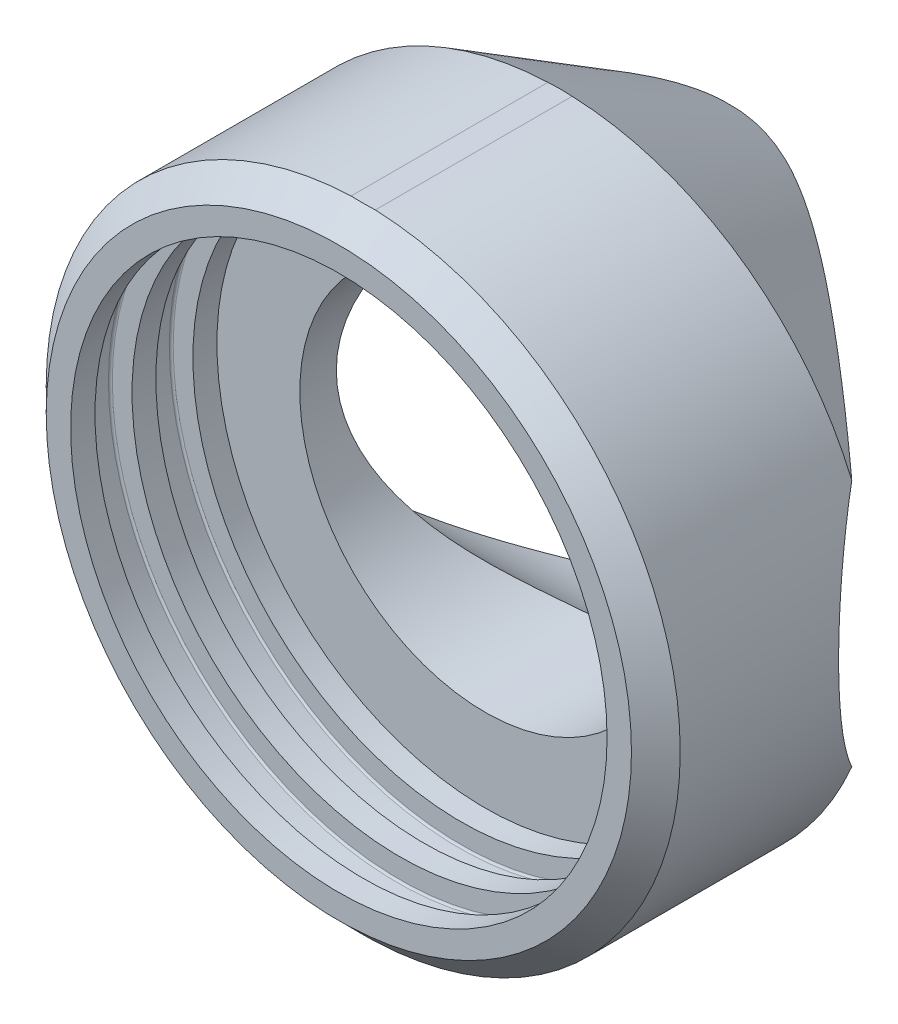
from build123d import *
from OCP.BRepFilletAPI import BRepFilletAPI_MakeChamfer

# Parameters (mm, degrees)
SKETCH1_R                = 41.275
BOSS_EXTRUDE1_DEPTH      = 50.8
SKETCH2_R                = 14.2875
CUT_EXTRUDE1_DEPTH       = 50.8
SKETCH3_R                = 34.925
CUT_EXTRUDE2_DEPTH       = 19.05
SKETCH4_R                = 24.13
CUT_EXTRUDE3_DEPTH       = 67.447827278
CUT_EXTRUDE6_DEPTH       = 78.381465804
CUT_EXTRUDE6_DEPTH_BACK  = 78.381465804
SKETCH5_R                = 28.575
CHAMFER1_SIZE            = 12.7
CHAMFER1_SIZE2           = 21.997045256
CHAMFER2_SIZE            = 3.175
CUT_EXTRUDE7_START       = -11.0998
SKETCH6_R                = 37.7444
CUT_EXTRUDE7_DEPTH       = 4.826
CUT_EXTRUDE8_START       = -3.175
SKETCH7_R                = 37.7444
CUT_EXTRUDE8_DEPTH       = 4.826
FILLET1_R                = 0.254
CUT_EXTRUDE9_DEPTH       = 78.381465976
CUT_EXTRUDE9_DEPTH_BACK  = 78.381465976
CUT_EXTRUDE10_DEPTH      = 78.381465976
CUT_EXTRUDE10_DEPTH_BACK = 78.381465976


with BuildPart() as part:
    # Sketch1 → Boss-Extrude1 (new body)
    with BuildSketch(Plane.XY):
        Circle(SKETCH1_R)
    extrude(amount=-BOSS_EXTRUDE1_DEPTH)

    # Sketch2 → Cut-Extrude1 (cut)
    with BuildSketch(Plane.XY):
        Circle(SKETCH2_R)
    extrude(amount=-CUT_EXTRUDE1_DEPTH, mode=Mode.SUBTRACT)

    # Sketch3 → Cut-Extrude2 (cut)
    with BuildSketch(Plane.XY):
        Circle(SKETCH3_R)
    extrude(amount=-CUT_EXTRUDE2_DEPTH, mode=Mode.SUBTRACT)

    # Sketch4 → Cut-Extrude3 (cut, through all)
    with BuildSketch(Plane.XY.offset(-19.05)):
        Circle(SKETCH4_R)
    extrude(amount=-CUT_EXTRUDE3_DEPTH, mode=Mode.SUBTRACT)

    # Sketch5 → Cut-Extrude6 (cut, two sides: drawn at the far end of the back side and taken through both)
    with BuildSketch(Plane(origin=(0, 0, 0), x_dir=(0, 0, -1), z_dir=(1, 0, 0)).offset(-CUT_EXTRUDE6_DEPTH_BACK)):
        with Locations((52.3748, 0)):
            Circle(SKETCH5_R)
    extrude(amount=CUT_EXTRUDE6_DEPTH + CUT_EXTRUDE6_DEPTH_BACK, mode=Mode.SUBTRACT)

    # Chamfer1: one chamfer whose edges measure the first distance from different faces: ONE call of the kernel's chamfer builder (chamfer() names one face for all edges)
    chamfer1_edges_1 = [part.edges().sort_by_distance(p)[0] for p in [
        (0, 41.275, -50.8),
    ]]
    chamfer1_side_1 = [part.faces().sort_by_distance(p)[0] for p in [
        (0, 33.70305067, -50.8),
    ]]
    chamfer1_edges_2 = [part.edges().sort_by_distance(p)[0] for p in [
        (0, -41.275, -50.8),
    ]]
    chamfer1_side_2 = [part.faces().sort_by_distance(p)[0] for p in [
        (0, -33.70305067, -50.8),
    ]]
    chamfer1 = BRepFilletAPI_MakeChamfer(part.part.solid().wrapped)
    for e in chamfer1_edges_1:
        chamfer1.Add(CHAMFER1_SIZE, CHAMFER1_SIZE2, e.wrapped, chamfer1_side_1[0].wrapped)  # the first distance lies on this face
    for e in chamfer1_edges_2:
        chamfer1.Add(CHAMFER1_SIZE, CHAMFER1_SIZE2, e.wrapped, chamfer1_side_2[0].wrapped)  # the first distance lies on this face
    add(Compound.cast(chamfer1.Shape()), mode=Mode.REPLACE)

    # Chamfer2
    chamfer2_edges = [part.edges().sort_by_distance(p)[0] for p in [
        (-41.275, 0, 0),
    ]]
    chamfer(chamfer2_edges, length=CHAMFER2_SIZE)

    # Sketch6 → Cut-Extrude7 (cut)
    with BuildSketch(Plane.XY.offset(CUT_EXTRUDE7_START)):
        Circle(SKETCH6_R)
    extrude(amount=-CUT_EXTRUDE7_DEPTH, mode=Mode.SUBTRACT)

    # Sketch7 → Cut-Extrude8 (cut)
    with BuildSketch(Plane.XY.offset(CUT_EXTRUDE8_START)):
        Circle(SKETCH7_R)
    extrude(amount=-CUT_EXTRUDE8_DEPTH, mode=Mode.SUBTRACT)

    # Fillet1
    fillet1_edges = [part.edges().sort_by_distance(p)[0] for p in [
        (-37.7444, 0, -11.0998),
        (-37.7444, 0, -15.9258),
        (-37.7444, 0, -3.175),
        (-37.7444, 0, -8.001),
    ]]
    fillet(fillet1_edges, radius=FILLET1_R)

    # Sketch8 → Cut-Extrude9 (cut, two sides: drawn at the far end of the back side and taken through both)
    with BuildSketch(Plane.XY.offset(-CUT_EXTRUDE9_DEPTH_BACK)):
        Polygon((-197.538742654, 41.24494672), (-1.5748, 41.24494672), (1.5748, 41.24494672), (197.538742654, 41.24494672), (197.538742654, 433.172832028), (-197.538742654, 433.172832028), align=None)
    extrude(amount=CUT_EXTRUDE9_DEPTH + CUT_EXTRUDE9_DEPTH_BACK, mode=Mode.SUBTRACT)

    # Sketch9 → Cut-Extrude10 (cut, two sides: drawn at the far end of the back side and taken through both)
    with BuildSketch(Plane.XY.offset(-CUT_EXTRUDE10_DEPTH_BACK)):
        Polygon((-197.48540115, -41.24494672), (-1.5748, -41.24494672), (1.5748, -41.24494672), (197.48540115, -41.24494672), (197.48540115, -433.066149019), (-197.48540115, -433.066149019), align=None)
    extrude(amount=CUT_EXTRUDE10_DEPTH + CUT_EXTRUDE10_DEPTH_BACK, mode=Mode.SUBTRACT)


solid = part.part
